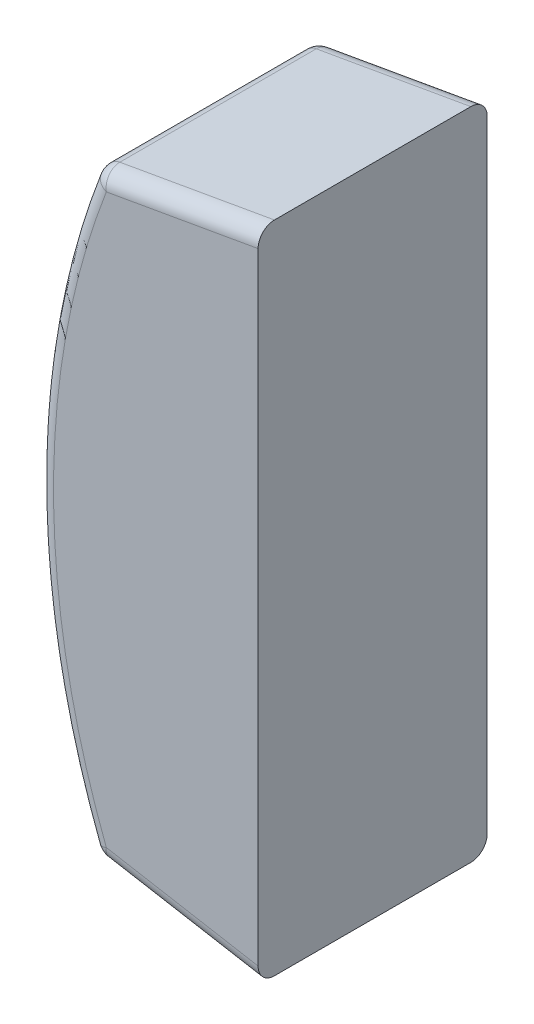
from build123d import *

# Parameters (mm, degrees)
BOSS_EXTRU_1_DEPTH = 28
CONG_1_R           = 2


with BuildPart() as part:
    # Esquisse1 → Boss.-Extru.1 (new body)
    with BuildSketch(Plane.XY):
        with BuildLine():
            Line((0, 0), (0, 80))
            Line((0, 80), (-20, 76.473460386))
            ThreePointArc((-20, 76.473460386), (-27, 40), (-20, 3.526539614))
            Line((-20, 3.526539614), (0, 0))
        make_face()
    extrude(amount=BOSS_EXTRU_1_DEPTH)

    # Cong_1
    cong_1_edges = [part.edges().sort_by_distance(p)[0] for p in [
        (-10, 78.236730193, 28),
        (-27, 40, 28),
        (-10, 1.763269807, 28),
        (-27, 40, 0),
        (-10, 78.236730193, 0),
        (-10, 1.763269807, 0),
        (-20, 3.526539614, 14),
        (-20, 76.473460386, 14),
    ]]
    fillet(cong_1_edges, radius=CONG_1_R)


solid = part.part
